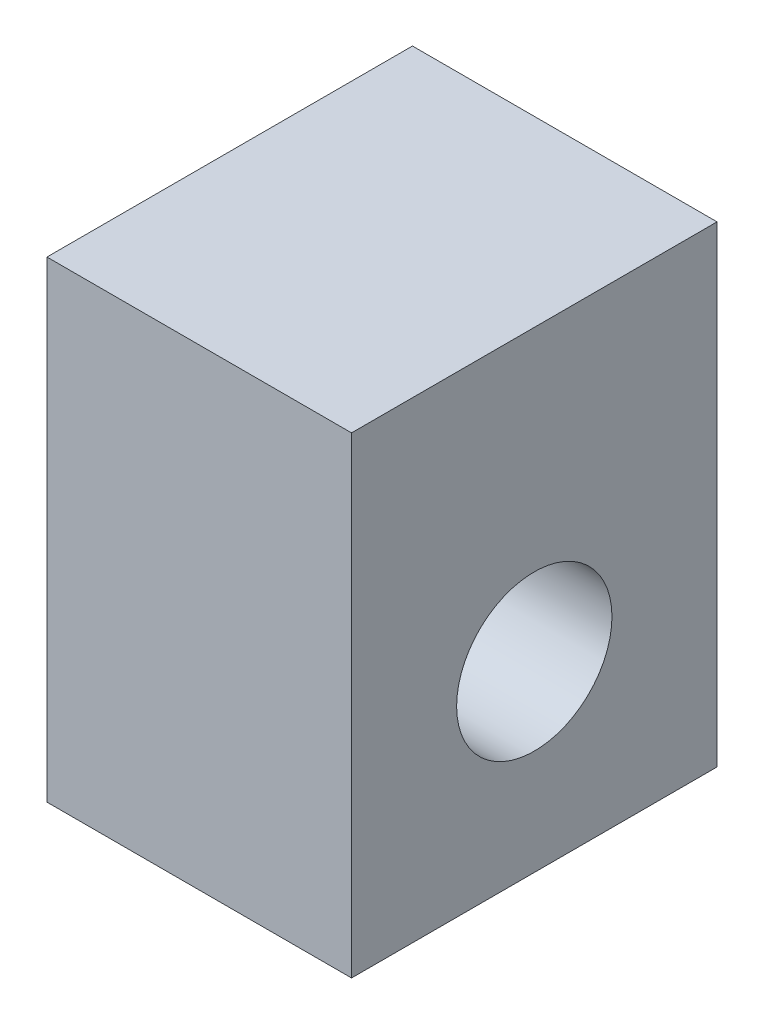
ISO-10303-21;
HEADER;
FILE_DESCRIPTION(('STEP AP214'),'2;1');
FILE_NAME('part.step','',(''),(''),'','','');
FILE_SCHEMA(('AUTOMOTIVE_DESIGN { 1 0 10303 214 1 1 1 1 }'));
ENDSEC;
DATA;
#1=APPLICATION_CONTEXT('core data for automotive mechanical design processes');
#2=APPLICATION_PROTOCOL_DEFINITION('international standard','automotive_design',2000,#1);
#3=PRODUCT_CONTEXT('',#1,'mechanical');
#4=PRODUCT('Part','Part','',(#3));
#5=PRODUCT_RELATED_PRODUCT_CATEGORY('part','',(#4));
#6=PRODUCT_DEFINITION_FORMATION('','',#4);
#7=PRODUCT_DEFINITION_CONTEXT('part definition',#1,'design');
#8=PRODUCT_DEFINITION('design','',#6,#7);
#9=PRODUCT_DEFINITION_SHAPE('','',#8);
#10=(LENGTH_UNIT() NAMED_UNIT(*) SI_UNIT(.MILLI.,.METRE.));
#11=(NAMED_UNIT(*) PLANE_ANGLE_UNIT() SI_UNIT($,.RADIAN.));
#12=(NAMED_UNIT(*) SI_UNIT($,.STERADIAN.) SOLID_ANGLE_UNIT());
#13=UNCERTAINTY_MEASURE_WITH_UNIT(LENGTH_MEASURE(1.E-05),#10,'distance_accuracy_value','');
#14=(GEOMETRIC_REPRESENTATION_CONTEXT(3) GLOBAL_UNCERTAINTY_ASSIGNED_CONTEXT((#13)) GLOBAL_UNIT_ASSIGNED_CONTEXT((#10,
#11,#12)) REPRESENTATION_CONTEXT('',''));
#15=CARTESIAN_POINT('',(0.,0.,0.));
#16=DIRECTION('',(0.,0.,1.));
#17=DIRECTION('',(1.,0.,0.));
#18=AXIS2_PLACEMENT_3D('',#15,#16,#17);
#19=CARTESIAN_POINT('',(10.,-19.,-12.));
#20=DIRECTION('',(1.,0.,0.));
#21=DIRECTION('',(0.,0.,-1.));
#22=AXIS2_PLACEMENT_3D('',#19,#20,#21);
#23=PLANE('',#22);
#24=CARTESIAN_POINT('',(10.,0.,0.));
#25=DIRECTION('',(1.,0.,0.));
#26=DIRECTION('',(0.,0.,-1.));
#27=AXIS2_PLACEMENT_3D('',#24,#25,#26);
#28=CIRCLE('',#27,5.1);
#29=CARTESIAN_POINT('',(10.,0.,-5.1));
#30=VERTEX_POINT('',#29);
#31=EDGE_CURVE('E112',#30,#30,#28,.T.);
#32=ORIENTED_EDGE('',*,*,#31,.F.);
#33=EDGE_LOOP('',(#32));
#34=FACE_BOUND('',#33,.T.);
#35=DIRECTION('',(0.,0.,1.));
#36=VECTOR('',#35,1.);
#37=CARTESIAN_POINT('',(10.,-12.,-12.));
#38=LINE('',#37,#36);
#39=CARTESIAN_POINT('',(10.,-12.,-12.));
#40=VERTEX_POINT('',#39);
#41=CARTESIAN_POINT('',(10.,-12.,12.));
#42=VERTEX_POINT('',#41);
#43=EDGE_CURVE('E56',#40,#42,#38,.T.);
#44=ORIENTED_EDGE('',*,*,#43,.F.);
#45=DIRECTION('',(0.,1.,0.));
#46=VECTOR('',#45,1.);
#47=CARTESIAN_POINT('',(10.,-19.,-12.));
#48=LINE('',#47,#46);
#49=CARTESIAN_POINT('',(10.,19.,-12.));
#50=VERTEX_POINT('',#49);
#51=EDGE_CURVE('E92',#40,#50,#48,.T.);
#52=ORIENTED_EDGE('',*,*,#51,.T.);
#53=DIRECTION('',(0.,0.,1.));
#54=VECTOR('',#53,1.);
#55=CARTESIAN_POINT('',(10.,19.,-12.));
#56=LINE('',#55,#54);
#57=CARTESIAN_POINT('',(10.,19.,12.));
#58=VERTEX_POINT('',#57);
#59=EDGE_CURVE('E82',#50,#58,#56,.T.);
#60=ORIENTED_EDGE('',*,*,#59,.T.);
#61=DIRECTION('',(0.,1.,0.));
#62=VECTOR('',#61,1.);
#63=CARTESIAN_POINT('',(10.,-19.,12.));
#64=LINE('',#63,#62);
#65=EDGE_CURVE('E96',#42,#58,#64,.T.);
#66=ORIENTED_EDGE('',*,*,#65,.F.);
#67=EDGE_LOOP('',(#44,#52,#60,#66));
#68=FACE_BOUND('',#67,.T.);
#69=ADVANCED_FACE('F41',(#34,#68),#23,.T.);
#70=CARTESIAN_POINT('',(-10.,-19.,-12.));
#71=DIRECTION('',(-1.,0.,0.));
#72=DIRECTION('',(0.,0.,1.));
#73=AXIS2_PLACEMENT_3D('',#70,#71,#72);
#74=PLANE('',#73);
#75=CARTESIAN_POINT('',(-10.,0.,0.));
#76=DIRECTION('',(-1.,0.,0.));
#77=DIRECTION('',(0.,0.,1.));
#78=AXIS2_PLACEMENT_3D('',#75,#76,#77);
#79=CIRCLE('',#78,5.1);
#80=CARTESIAN_POINT('',(-10.,0.,5.1));
#81=VERTEX_POINT('',#80);
#82=EDGE_CURVE('E44',#81,#81,#79,.T.);
#83=ORIENTED_EDGE('',*,*,#82,.F.);
#84=EDGE_LOOP('',(#83));
#85=FACE_BOUND('',#84,.T.);
#86=DIRECTION('',(0.,0.,-1.));
#87=VECTOR('',#86,1.);
#88=CARTESIAN_POINT('',(-10.,-12.,-12.));
#89=LINE('',#88,#87);
#90=CARTESIAN_POINT('',(-10.,-12.,12.));
#91=VERTEX_POINT('',#90);
#92=CARTESIAN_POINT('',(-10.,-12.,-12.));
#93=VERTEX_POINT('',#92);
#94=EDGE_CURVE('E90',#91,#93,#89,.T.);
#95=ORIENTED_EDGE('',*,*,#94,.F.);
#96=DIRECTION('',(0.,-1.,0.));
#97=VECTOR('',#96,1.);
#98=CARTESIAN_POINT('',(-10.,-19.,12.));
#99=LINE('',#98,#97);
#100=CARTESIAN_POINT('',(-10.,19.,12.));
#101=VERTEX_POINT('',#100);
#102=EDGE_CURVE('E86',#101,#91,#99,.T.);
#103=ORIENTED_EDGE('',*,*,#102,.F.);
#104=DIRECTION('',(0.,0.,1.));
#105=VECTOR('',#104,1.);
#106=CARTESIAN_POINT('',(-10.,19.,-12.));
#107=LINE('',#106,#105);
#108=CARTESIAN_POINT('',(-10.,19.,-12.));
#109=VERTEX_POINT('',#108);
#110=EDGE_CURVE('E49',#109,#101,#107,.T.);
#111=ORIENTED_EDGE('',*,*,#110,.F.);
#112=DIRECTION('',(0.,-1.,0.));
#113=VECTOR('',#112,1.);
#114=CARTESIAN_POINT('',(-10.,-19.,-12.));
#115=LINE('',#114,#113);
#116=EDGE_CURVE('E103',#109,#93,#115,.T.);
#117=ORIENTED_EDGE('',*,*,#116,.T.);
#118=EDGE_LOOP('',(#95,#103,#111,#117));
#119=FACE_BOUND('',#118,.T.);
#120=ADVANCED_FACE('F87',(#85,#119),#74,.T.);
#121=CARTESIAN_POINT('',(-10.,19.,-12.));
#122=DIRECTION('',(0.,1.,0.));
#123=DIRECTION('',(0.,0.,1.));
#124=AXIS2_PLACEMENT_3D('',#121,#122,#123);
#125=PLANE('',#124);
#126=DIRECTION('',(-1.,0.,0.));
#127=VECTOR('',#126,1.);
#128=CARTESIAN_POINT('',(-10.,19.,12.));
#129=LINE('',#128,#127);
#130=EDGE_CURVE('E79',#58,#101,#129,.T.);
#131=ORIENTED_EDGE('',*,*,#130,.F.);
#132=ORIENTED_EDGE('',*,*,#59,.F.);
#133=DIRECTION('',(-1.,0.,0.));
#134=VECTOR('',#133,1.);
#135=CARTESIAN_POINT('',(-10.,19.,-12.));
#136=LINE('',#135,#134);
#137=EDGE_CURVE('E81',#50,#109,#136,.T.);
#138=ORIENTED_EDGE('',*,*,#137,.T.);
#139=ORIENTED_EDGE('',*,*,#110,.T.);
#140=EDGE_LOOP('',(#131,#132,#138,#139));
#141=FACE_BOUND('',#140,.T.);
#142=ADVANCED_FACE('F76',(#141),#125,.T.);
#143=CARTESIAN_POINT('',(0.,0.,-12.));
#144=DIRECTION('',(0.,0.,-1.));
#145=DIRECTION('',(-1.,0.,0.));
#146=AXIS2_PLACEMENT_3D('',#143,#144,#145);
#147=PLANE('',#146);
#148=DIRECTION('',(1.,0.,0.));
#149=VECTOR('',#148,1.);
#150=CARTESIAN_POINT('',(0.,-12.,-12.));
#151=LINE('',#150,#149);
#152=EDGE_CURVE('E99',#93,#40,#151,.T.);
#153=ORIENTED_EDGE('',*,*,#152,.F.);
#154=ORIENTED_EDGE('',*,*,#116,.F.);
#155=ORIENTED_EDGE('',*,*,#137,.F.);
#156=ORIENTED_EDGE('',*,*,#51,.F.);
#157=EDGE_LOOP('',(#153,#154,#155,#156));
#158=FACE_BOUND('',#157,.T.);
#159=ADVANCED_FACE('F128',(#158),#147,.T.);
#160=CARTESIAN_POINT('',(0.,0.,12.));
#161=DIRECTION('',(0.,0.,-1.));
#162=DIRECTION('',(-1.,0.,0.));
#163=AXIS2_PLACEMENT_3D('',#160,#161,#162);
#164=PLANE('',#163);
#165=ORIENTED_EDGE('',*,*,#102,.T.);
#166=DIRECTION('',(1.,0.,0.));
#167=VECTOR('',#166,1.);
#168=CARTESIAN_POINT('',(0.,-12.,12.));
#169=LINE('',#168,#167);
#170=EDGE_CURVE('E11',#91,#42,#169,.T.);
#171=ORIENTED_EDGE('',*,*,#170,.T.);
#172=ORIENTED_EDGE('',*,*,#65,.T.);
#173=ORIENTED_EDGE('',*,*,#130,.T.);
#174=EDGE_LOOP('',(#165,#171,#172,#173));
#175=FACE_BOUND('',#174,.T.);
#176=ADVANCED_FACE('F94',(#175),#164,.F.);
#177=CARTESIAN_POINT('',(-30.,-12.,-50.));
#178=DIRECTION('',(0.,1.,0.));
#179=DIRECTION('',(0.,0.,1.));
#180=AXIS2_PLACEMENT_3D('',#177,#178,#179);
#181=PLANE('',#180);
#182=ORIENTED_EDGE('',*,*,#152,.T.);
#183=ORIENTED_EDGE('',*,*,#43,.T.);
#184=ORIENTED_EDGE('',*,*,#170,.F.);
#185=ORIENTED_EDGE('',*,*,#94,.T.);
#186=EDGE_LOOP('',(#182,#183,#184,#185));
#187=FACE_BOUND('',#186,.T.);
#188=ADVANCED_FACE('F133',(#187),#181,.F.);
#189=CARTESIAN_POINT('',(-25.,0.,0.));
#190=DIRECTION('',(1.,0.,0.));
#191=DIRECTION('',(0.,0.,-1.));
#192=AXIS2_PLACEMENT_3D('',#189,#190,#191);
#193=CYLINDRICAL_SURFACE('',#192,5.1);
#194=ORIENTED_EDGE('',*,*,#31,.T.);
#195=EDGE_LOOP('',(#194));
#196=FACE_BOUND('',#195,.T.);
#197=ORIENTED_EDGE('',*,*,#82,.T.);
#198=EDGE_LOOP('',(#197));
#199=FACE_BOUND('',#198,.T.);
#200=ADVANCED_FACE('F119',(#196,#199),#193,.F.);
#201=CLOSED_SHELL('',(#69,#120,#142,#159,#176,#188,#200));
#202=MANIFOLD_SOLID_BREP('B2',#201);
#203=ADVANCED_BREP_SHAPE_REPRESENTATION('',(#18,#202),#14);
#204=SHAPE_DEFINITION_REPRESENTATION(#9,#203);
ENDSEC;
END-ISO-10303-21;
